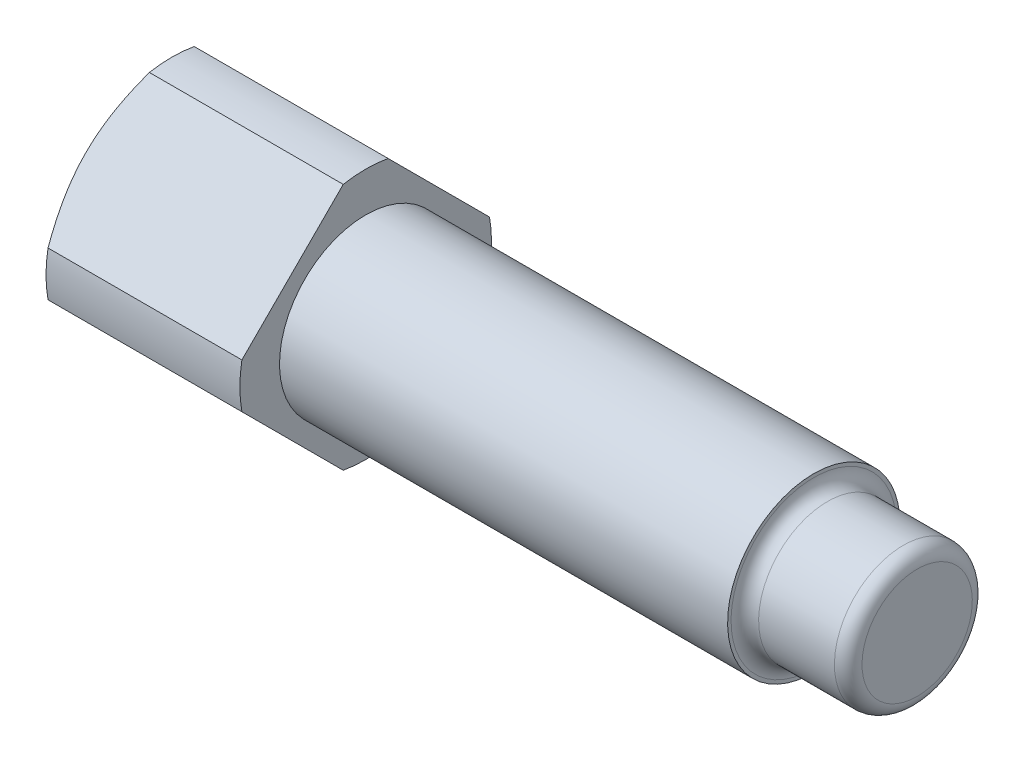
from build123d import *

# Parameters (mm, degrees)
SKETCH1_R          = 3.65
BASEHEAD_DEPTH     = 6
SKETCH2_OUTSIDE_W  = 11.688
SKETCH2_OUTSIDE_H  = 11.688
CUT_EXTRUDE1_DEPTH = 6
FILLET1_R          = 0.4


with BuildPart() as part:
    # Sketch1 → BaseHead (new body)
    with BuildSketch(Plane(origin=(0, 0, 0), x_dir=(0, 0, -1), z_dir=(1, 0, 0))):
        Circle(SKETCH1_R)
    extrude(amount=BASEHEAD_DEPTH)

    # Sketch2 outside → Cut-Extrude1 (cut)
    with BuildSketch(Plane(origin=(0, 2.393227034, 1.175154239), x_dir=(0, 0, 1), z_dir=(-1, 0, 0))):
        with Locations((-1.175, -2.393)):
            Rectangle(SKETCH2_OUTSIDE_W, SKETCH2_OUTSIDE_H)
        Polygon((3.067486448, -2.393227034), (-1.175154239, 1.849413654), (-5.417794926, -2.393227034), (-1.175154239, -6.635867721), align=None, mode=Mode.SUBTRACT)
    extrude(amount=-CUT_EXTRUDE1_DEPTH, mode=Mode.SUBTRACT)

    # Sketch3 → Cut-Revolve1 (revolve, cut)
    with BuildSketch(Plane(origin=(1.259716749, -5.274716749, 0), x_dir=(0, -1, 0), z_dir=(0, 0, 1))):
        Polygon((-9.289716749, -1.259716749), (-8.274716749, -1.259716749), (-9.289716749, -0.673706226), align=None)
    revolve(axis=Axis((1.545283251, 0, 0), (-1, 0, 0)), mode=Mode.SUBTRACT)

    # Sketch4 → BaseBody (revolve)
    with BuildSketch(Plane(origin=(-6.130205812, 8.630205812, 0), x_dir=(0, -1, 0), z_dir=(0, 0, 1)), mode=Mode.PRIVATE) as basebody_sk:
        Polygon((8.630205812, 12.130205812), (11.130205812, 12.130205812), (11.130205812, 25.130205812), (10.630205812, 25.130205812), (10.630205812, 28.130205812), (8.630205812, 28.130205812), align=None)
    revolve(basebody_sk.sketch.rotate(Axis((6.566383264, 0, 0), (-1, 0, 0)), 180), axis=Axis((6.566383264, 0, 0), (-1, 0, 0)))

    # Fillet1
    fillet1_edges = [part.edges().sort_by_distance(p)[0] for p in [
        (19, -2, 0),
        (22, -2, 0),
    ]]
    fillet(fillet1_edges, radius=FILLET1_R)


solid = part.part
